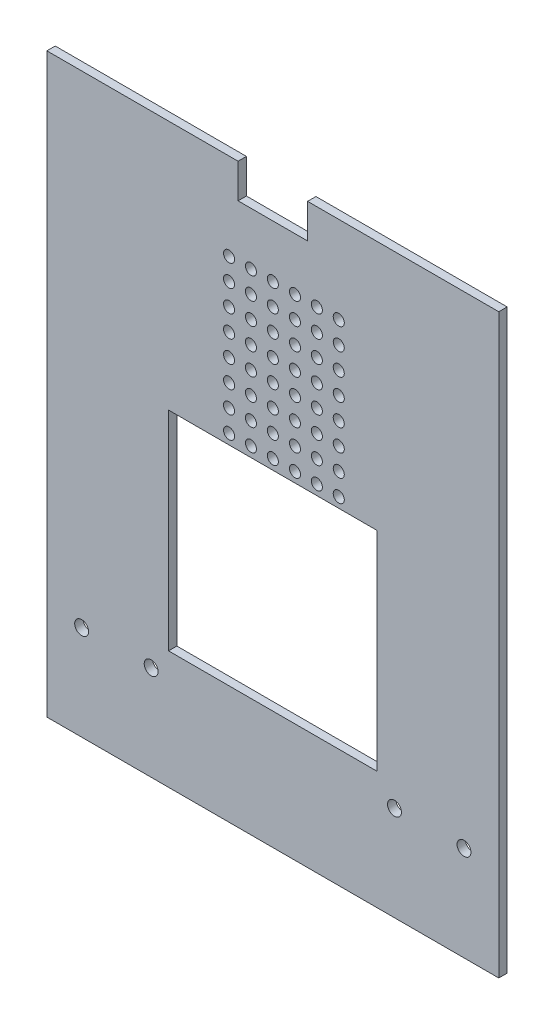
from build123d import *

# Parameters (mm, degrees)
SKETCH1_W           = 165.1
SKETCH1_H           = 292.1
BOSS_EXTRUDE1_DEPTH = 3.048
SKETCH2_R           = 10.7315
SKETCH2_R_2         = 2.0193
SKETCH2_W           = 16.173788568
SKETCH2_H           = 32.6898
SKETCH2_W_2         = 76.2
SKETCH2_H_2         = 76.2
CUT_EXTRUDE1_DEPTH  = 168.792715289
CUT_EXTRUDE2_DEPTH  = 168.792715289
SKETCH5_R           = 2.54
CUT_EXTRUDE3_DEPTH  = 168.792715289
SKETCH6_W           = 165.1
SKETCH6_H           = 5.08
CUT_EXTRUDE4_DEPTH  = 168.792715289


with BuildPart() as part:
    # Sketch1 → Boss-Extrude1 (new body)
    with BuildSketch(Plane.XY):
        Rectangle(SKETCH1_W, SKETCH1_H)
    extrude(amount=BOSS_EXTRUDE1_DEPTH)

    # Sketch2 → Cut-Extrude1 (cut, through all)
    with BuildSketch(Plane.XY):
        with Locations((0, 92.71)):
            Circle(SKETCH2_R)
        with Locations(Location((0, 38.1, 0), (0, 0, 180))):
            Circle(SKETCH2_R_2)
        with Locations(Location((0, 30.1, 0), (0, 0, 180))):
            Circle(SKETCH2_R_2)
        with Locations(Location((0, 22.1, 0), (0, 0, 180))):
            Circle(SKETCH2_R_2)
        with Locations(Location((0, 14.1, 0), (0, 0, 180))):
            Circle(SKETCH2_R_2)
        with Locations(Location((0, 6.1, 0), (0, 0, 180))):
            Circle(SKETCH2_R_2)
        with Locations(Location((0, -1.9, 0), (0, 0, 180))):
            Circle(SKETCH2_R_2)
        with Locations(Location((0, -9.9, 0), (0, 0, 180))):
            Circle(SKETCH2_R_2)
        with Locations(Location((0, -17.9, 0), (0, 0, 180))):
            Circle(SKETCH2_R_2)
        with Locations(Location((-8, 38.1, 0), (0, 0, 180))):
            Circle(SKETCH2_R_2)
        with Locations(Location((-16, 38.1, 0), (0, 0, 180))):
            Circle(SKETCH2_R_2)
        with Locations(Location((-8, 30.1, 0), (0, 0, 180))):
            Circle(SKETCH2_R_2)
        with Locations(Location((-16, 30.1, 0), (0, 0, 180))):
            Circle(SKETCH2_R_2)
        with Locations(Location((-8, 22.1, 0), (0, 0, 180))):
            Circle(SKETCH2_R_2)
        with Locations(Location((-16, 22.1, 0), (0, 0, 180))):
            Circle(SKETCH2_R_2)
        with Locations(Location((-8, 14.1, 0), (0, 0, 180))):
            Circle(SKETCH2_R_2)
        with Locations(Location((-16, 14.1, 0), (0, 0, 180))):
            Circle(SKETCH2_R_2)
        with Locations(Location((-8, 6.1, 0), (0, 0, 180))):
            Circle(SKETCH2_R_2)
        with Locations(Location((-16, 6.1, 0), (0, 0, 180))):
            Circle(SKETCH2_R_2)
        with Locations(Location((-8, -1.9, 0), (0, 0, 180))):
            Circle(SKETCH2_R_2)
        with Locations(Location((-16, -1.9, 0), (0, 0, 180))):
            Circle(SKETCH2_R_2)
        with Locations(Location((-8, -9.9, 0), (0, 0, 180))):
            Circle(SKETCH2_R_2)
        with Locations(Location((-16, -9.9, 0), (0, 0, 180))):
            Circle(SKETCH2_R_2)
        with Locations(Location((-8, -17.9, 0), (0, 0, 180))):
            Circle(SKETCH2_R_2)
        with Locations(Location((-16, -17.9, 0), (0, 0, 180))):
            Circle(SKETCH2_R_2)
        with Locations(Location((24.086894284, 14.1, 0), (0, 0, 180))):
            Circle(SKETCH2_R_2)
        with Locations(Location((8.086894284, 14.1, 0), (0, 0, 180))):
            Circle(SKETCH2_R_2)
        with Locations(Location((8.086894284, -17.9, 0), (0, 0, 180))):
            Circle(SKETCH2_R_2)
        with Locations(Location((24.086894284, 6.1, 0), (0, 0, 180))):
            Circle(SKETCH2_R_2)
        with Locations(Location((16.086894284, 6.1, 0), (0, 0, 180))):
            Circle(SKETCH2_R_2)
        with Locations(Location((8.086894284, -1.9, 0), (0, 0, 180))):
            Circle(SKETCH2_R_2)
        with Locations(Location((8.086894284, 30.1, 0), (0, 0, 180))):
            Circle(SKETCH2_R_2)
        with Locations(Location((24.086894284, 22.1, 0), (0, 0, 180))):
            Circle(SKETCH2_R_2)
        with Locations(Location((24.086894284, -1.9, 0), (0, 0, 180))):
            Circle(SKETCH2_R_2)
        with Locations(Location((24.086894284, -9.9, 0), (0, 0, 180))):
            Circle(SKETCH2_R_2)
        with Locations(Location((8.086894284, 6.1, 0), (0, 0, 180))):
            Circle(SKETCH2_R_2)
        with Locations(Location((16.086894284, 22.1, 0), (0, 0, 180))):
            Circle(SKETCH2_R_2)
        with Locations(Location((8.086894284, 22.1, 0), (0, 0, 180))):
            Circle(SKETCH2_R_2)
        with Locations(Location((8.086894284, -9.9, 0), (0, 0, 180))):
            Circle(SKETCH2_R_2)
        with Locations(Location((24.086894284, -17.9, 0), (0, 0, 180))):
            Circle(SKETCH2_R_2)
        with Locations(Location((16.086894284, 14.1, 0), (0, 0, 180))):
            Circle(SKETCH2_R_2)
        with Locations(Location((16.086894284, -17.9, 0), (0, 0, 180))):
            Circle(SKETCH2_R_2)
        with Locations(Location((16.086894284, 30.1, 0), (0, 0, 180))):
            Circle(SKETCH2_R_2)
        with Locations(Location((24.086894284, 30.1, 0), (0, 0, 180))):
            Circle(SKETCH2_R_2)
        with Locations(Location((16.086894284, -9.9, 0), (0, 0, 180))):
            Circle(SKETCH2_R_2)
        with Locations(Location((16.086894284, -1.9, 0), (0, 0, 180))):
            Circle(SKETCH2_R_2)
        with Locations(Location((16.086894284, 38.1, 0), (0, 0, 180))):
            Circle(SKETCH2_R_2)
        with Locations(Location((8.086894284, 38.1, 0), (0, 0, 180))):
            Circle(SKETCH2_R_2)
        with Locations(Location((24.086894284, 38.1, 0), (0, 0, 180))):
            Circle(SKETCH2_R_2)
        with Locations((0, 92.71)):
            Rectangle(SKETCH2_W, SKETCH2_H)
        with Locations((0, -59.69)):
            Rectangle(SKETCH2_W_2, SKETCH2_H_2)
    extrude(amount=CUT_EXTRUDE1_DEPTH, mode=Mode.SUBTRACT)

    # Sketch4 → Cut-Extrude2 (cut, through all)
    with BuildSketch(Plane.XY):
        Polygon((-12.7, 57.310847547), (-12.7, 69.85), (-82.55, 69.85), (-82.55, 146.05), (82.55, 146.05), (82.55, 69.85), (12.7, 69.85), (12.7, 57.310847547), align=None)
    extrude(amount=CUT_EXTRUDE2_DEPTH, mode=Mode.SUBTRACT)

    # Sketch5 → Cut-Extrude3 (cut, through all)
    with BuildSketch(Plane(origin=(0, 0, 0), x_dir=(-1, 0, 0), z_dir=(0, 0, -1))):
        with Locations((-44.45, -106.299)):
            Circle(SKETCH5_R)
        with Locations((-69.85, -106.299)):
            Circle(SKETCH5_R)
        with Locations((69.85, -106.299)):
            Circle(SKETCH5_R)
        with Locations((44.45, -106.299)):
            Circle(SKETCH5_R)
    extrude(amount=-CUT_EXTRUDE3_DEPTH, mode=Mode.SUBTRACT)

    # Sketch6 → Cut-Extrude4 (cut, through all)
    with BuildSketch(Plane(origin=(0, 0, 0), x_dir=(-1, 0, 0), z_dir=(0, 0, -1))):
        with Locations((0, -143.51)):
            Rectangle(SKETCH6_W, SKETCH6_H)
    extrude(amount=-CUT_EXTRUDE4_DEPTH, mode=Mode.SUBTRACT)


solid = part.part
